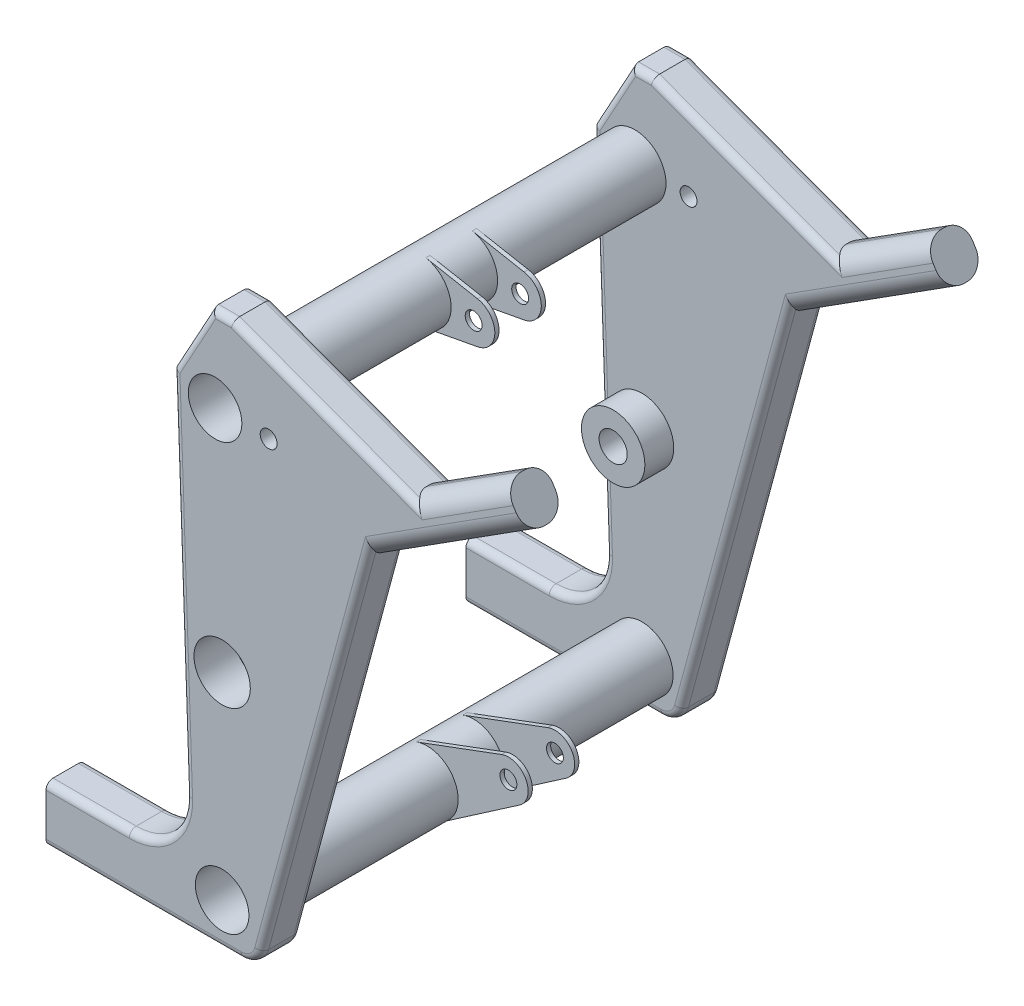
from build123d import *

# Parameters (mm, degrees)
ESQUISSE1_R                  = 22.5
ESQUISSE1_R_2                = 10
EXTRUSION1_DEPTH             = 135.5
ESQUISSE2_R                  = 22
ESQUISSE2_R_2                = 19
EXTRUSION2_DEPTH             = 135
ESQUISSE3_R                  = 22
ESQUISSE3_R_2                = 19
EXTRUSION3_DEPTH             = 135
ESQUISSE6_R                  = 6
ESQUISSE6_R_2                = 19
EXTRUSION4_DEPTH             = 3
R_P_TITION_LIN_AIRE1_COUNT   = 2
R_P_TITION_LIN_AIRE1_PITCH   = 33
ESQUISSE7_R                  = 6
ESQUISSE7_R_2                = 19
EXTRUSION5_DEPTH             = 3
R_P_TITION_LIN_AIRE2_COUNT   = 2
R_P_TITION_LIN_AIRE2_PITCH   = 33
ENL_V_MAT_EXTRU_1_DEPTH      = 114
ENL_V_MAT_EXTRU_1_DEPTH_BACK = 114
ESQUISSE8_R                  = 22.5
ESQUISSE9_R                  = 19
ESQUISSE9_R_2                = 10
ESQUISSE9_R_3                = 6
EXTRUSION6_DEPTH             = 28
R_P_TITION_LIN_AIRE3_COUNT   = 2
R_P_TITION_LIN_AIRE3_PITCH   = 298
ESQUISSE10_R                 = 20
ENL_V_MAT_EXTRU_2_DEPTH      = 28
ESQUISSE11_R                 = 22.5
ENL_V_MAT_EXTRU_3_DEPTH      = 28
CONG_1_R                     = 13
CONG_2_R                     = 13
CONG_4_R                     = 15
CONG_5_R                     = 15
CONG_6_R                     = 40
CONG_3_R                     = 5
CONG_7_R                     = 40
CONG_8_R                     = 5


with BuildPart() as part:
    # Esquisse1 → Extrusion1 (new, symmetric)
    with BuildSketch(Plane.XY):
        Circle(ESQUISSE1_R)
        Circle(ESQUISSE1_R_2, mode=Mode.SUBTRACT)
    extrude(amount=EXTRUSION1_DEPTH, both=True)

    # Esquisse8 → Enl_v. mat.-Extru.1 (cut, two sides: drawn at the far end of the back side and taken through both)
    with BuildSketch(Plane.XY.offset(-ENL_V_MAT_EXTRU_1_DEPTH_BACK)):
        Circle(ESQUISSE8_R)
    extrude(amount=ENL_V_MAT_EXTRU_1_DEPTH + ENL_V_MAT_EXTRU_1_DEPTH_BACK, mode=Mode.SUBTRACT)


with BuildPart() as body_2:
    # Esquisse2 → Extrusion2 (new, symmetric)
    with BuildSketch(Plane.XY):
        with Locations((0, -140)):
            Circle(ESQUISSE2_R)
        with Locations((0, -140)):
            Circle(ESQUISSE2_R_2, mode=Mode.SUBTRACT)
    extrude(amount=EXTRUSION2_DEPTH, both=True)

    # Esquisse7 → Extrusion5 (add)
    with BuildSketch(Plane.XY.offset(15)):
        with BuildLine():
            Line((-7.674599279, -119.382033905), (52.778977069, -96.879476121))
            ThreePointArc((52.778977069, -96.879476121), (70.082495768, -103.538461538), (65.603801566, -121.529991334))
            Line((65.603801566, -121.529991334), (12.47869636, -158.118557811))
            ThreePointArc((12.47869636, -158.118557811), (-19.516644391, -150.153846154), (-7.674599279, -119.382033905))
        make_face()
        with Locations((57.662812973, -110)):
            Circle(ESQUISSE7_R, mode=Mode.SUBTRACT)
        with Locations((0, -140)):
            Circle(ESQUISSE7_R_2, mode=Mode.SUBTRACT)
    extrusion5 = extrude(amount=EXTRUSION5_DEPTH)

    # R_p_tition lin_aire2: Extrusion5 ×2
    with Locations(*[(0, 0, -i * R_P_TITION_LIN_AIRE2_PITCH) for i in range(1, R_P_TITION_LIN_AIRE2_COUNT)]):
        add(extrusion5)


with BuildPart() as body_3:
    # Esquisse3 → Extrusion3 (new, symmetric)
    with BuildSketch(Plane.XY):
        with Locations((-5, 159.921855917)):
            Circle(ESQUISSE3_R)
        with Locations((-5, 159.921855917)):
            Circle(ESQUISSE3_R_2, mode=Mode.SUBTRACT)
    extrude(amount=EXTRUSION3_DEPTH, both=True)

    # Esquisse6 → Extrusion4 (add)
    with BuildSketch(Plane.XY.offset(15)):
        with BuildLine():
            Line((35.763157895, 174.665158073), (-0.947368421, 181.545365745))
            ThreePointArc((-0.947368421, 181.545365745), (-27, 159.921855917), (-0.947368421, 138.298346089))
            Line((-0.947368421, 138.298346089), (35.763157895, 145.178553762))
            ThreePointArc((35.763157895, 145.178553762), (48, 159.921855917), (35.763157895, 174.665158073))
        make_face()
        with Locations((33, 159.921855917)):
            Circle(ESQUISSE6_R, mode=Mode.SUBTRACT)
        with Locations((-5, 159.921855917)):
            Circle(ESQUISSE6_R_2, mode=Mode.SUBTRACT)
    extrusion4 = extrude(amount=EXTRUSION4_DEPTH)

    # R_p_tition lin_aire1: Extrusion4 ×2
    with Locations(*[(0, 0, -i * R_P_TITION_LIN_AIRE1_PITCH) for i in range(1, R_P_TITION_LIN_AIRE1_COUNT)]):
        add(extrusion4)


with BuildPart() as enl_v_mat_extru_1_piece_1:
    # of the separate pieces the step leaves, piece 1, a body of its own (enl_v_mat_extru_1_pieces)
    add(part.part.solids().sort_by_distance((22.5, 0, -135.5))[0])


with BuildPart() as enl_v_mat_extru_1_piece_2:
    # of the separate pieces the step leaves, piece 2, a body of its own (enl_v_mat_extru_1_pieces)
    add(part.part.solids().sort_by_distance((22.5, 0, 114))[0])

    # Esquisse9 → Extrusion6 (add)
    with BuildSketch(Plane.XY.offset(135.5)):
        Polygon((-35, 169.817248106), (-24.530150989, -130), (-125, -130), (-125, -170), (25, -170), (103, 119.68258491), (215.644974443, 191.348346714), (199.54149325, 216.659962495), (132.043851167, 173.71734598), (7.5, 219.921855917), (-7.5, 219.921855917), align=None)
        with Locations((-5, 159.921855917)):
            Circle(ESQUISSE9_R, mode=Mode.SUBTRACT)
        Circle(ESQUISSE9_R_2, mode=Mode.SUBTRACT)
        with Locations((0, -140)):
            Circle(ESQUISSE9_R, mode=Mode.SUBTRACT)
        with Locations((33, 159.921855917)):
            Circle(ESQUISSE9_R_3, mode=Mode.SUBTRACT)
    extrusion6 = extrude(amount=EXTRUSION6_DEPTH)

    # Esquisse10 → Enl_v. mat.-Extru.2 (cut)
    with BuildSketch(Plane.XY.offset(163.5)):
        Circle(ESQUISSE10_R)
    extrude(amount=-ENL_V_MAT_EXTRU_2_DEPTH, mode=Mode.SUBTRACT)

    # Cong_1
    cong_1_edges = [enl_v_mat_extru_1_piece_2.edges().sort_by_distance(p)[0] for p in [
        (159.322487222, 155.515465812, 163.5),
        (165.792672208, 195.188654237, 163.5),
        (159.322487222, 155.515465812, 135.5),
        (165.792672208, 195.188654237, 135.5),
    ]]
    fillet(cong_1_edges, radius=CONG_1_R)

    # Cong_4
    cong_4_edges = [enl_v_mat_extru_1_piece_2.edges().sort_by_distance(p)[0] for p in [
        (25, -170, 149.5),
    ]]
    fillet(cong_4_edges, radius=CONG_4_R)

    # Cong_6
    cong_6_edges = [enl_v_mat_extru_1_piece_2.edges().sort_by_distance(p)[0] for p in [
        (-24.530150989, -130, 149.5),
    ]]
    fillet(cong_6_edges, radius=CONG_6_R)

    # Cong_3
    cong_3_edges = [enl_v_mat_extru_1_piece_2.edges().sort_by_distance(p)[0] for p in [
        (-55.747670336, -170, 135.5),
        (-30.48786523, 40.606613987, 135.5),
        (-21.25, 194.869552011, 135.5),
        (-55.747670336, -170, 163.5),
        (-95.47568177, -130, 135.5),
        (-95.47568177, -130, 163.5),
        (-30.48786523, 40.606613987, 163.5),
        (-21.25, 194.869552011, 163.5),
        (0, 219.921855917, 135.5),
        (0, 219.921855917, 163.5),
        (77.420833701, 193.981933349, 135.5),
        (77.420833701, 193.981933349, 163.5),
        (67.997577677, -10.312186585, 135.5),
        (67.997577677, -10.312186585, 163.5),
        (-37.177771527, -117.786334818, 135.5),
        (-37.177771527, -117.786334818, 163.5),
        (22.628803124, -166.9058809, 135.5),
        (22.628803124, -166.9058809, 163.5),
    ]]
    fillet(cong_3_edges, radius=CONG_3_R)


with BuildPart() as enl_v_mat_extru_1_piece_1_1:
    add(enl_v_mat_extru_1_piece_1.part)

    # R_p_tition lin_aire3: Extrusion6 ×2
    with Locations(*[(0, 0, -i * R_P_TITION_LIN_AIRE3_PITCH) for i in range(1, R_P_TITION_LIN_AIRE3_COUNT)]):
        add(extrusion6)

    # Esquisse11 → Enl_v. mat.-Extru.3 (cut)
    with BuildSketch(Plane(origin=(0, 0, -162.5), x_dir=(-1, 0, 0), z_dir=(0, 0, -1))):
        Circle(ESQUISSE11_R)
    extrude(amount=-ENL_V_MAT_EXTRU_3_DEPTH, mode=Mode.SUBTRACT)


with BuildPart() as enl_v_mat_extru_3_piece_1:
    # of the separate pieces the step leaves, piece 1, a body of its own (enl_v_mat_extru_3_pieces)
    add(enl_v_mat_extru_1_piece_1_1.part.solids().sort_by_distance((-35, 169.817248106, -134.5))[0])

    # Cong_2
    cong_2_edges = [enl_v_mat_extru_3_piece_1.edges().sort_by_distance(p)[0] for p in [
        (159.322487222, 155.515465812, -162.5),
        (165.792672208, 195.188654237, -162.5),
        (159.322487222, 155.515465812, -134.5),
        (165.792672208, 195.188654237, -134.5),
    ]]
    fillet(cong_2_edges, radius=CONG_2_R)

    # Cong_5
    cong_5_edges = [enl_v_mat_extru_3_piece_1.edges().sort_by_distance(p)[0] for p in [
        (25, -170, -148.5),
    ]]
    fillet(cong_5_edges, radius=CONG_5_R)

    # Cong_7
    cong_7_edges = [enl_v_mat_extru_3_piece_1.edges().sort_by_distance(p)[0] for p in [
        (-24.530150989, -130, -148.5),
    ]]
    fillet(cong_7_edges, radius=CONG_7_R)

    # Cong_8
    cong_8_edges = [enl_v_mat_extru_3_piece_1.edges().sort_by_distance(p)[0] for p in [
        (67.997577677, -10.312186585, -162.5),
        (22.628803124, -166.9058809, -162.5),
        (-95.47568177, -130, -162.5),
        (-37.177771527, -117.786334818, -162.5),
        (-55.747670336, -170, -162.5),
        (-30.48786523, 40.606613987, -162.5),
        (-21.25, 194.869552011, -162.5),
        (0, 219.921855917, -162.5),
        (77.420833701, 193.981933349, -162.5),
        (67.997577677, -10.312186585, -134.5),
        (22.628803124, -166.9058809, -134.5),
        (-30.48786523, 40.606613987, -134.5),
        (-37.177771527, -117.786334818, -134.5),
        (77.420833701, 193.981933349, -134.5),
        (0, 219.921855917, -134.5),
        (-55.747670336, -170, -134.5),
        (-21.25, 194.869552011, -134.5),
        (-95.47568177, -130, -134.5),
    ]]
    fillet(cong_8_edges, radius=CONG_8_R)


with BuildPart() as enl_v_mat_extru_3_piece_2:
    # of the separate pieces the step leaves, piece 2, a body of its own (enl_v_mat_extru_3_pieces)
    add(enl_v_mat_extru_1_piece_1_1.part.solids().sort_by_distance((10, 0, -114))[0])


solid = Compound([body_2.part, body_3.part, enl_v_mat_extru_1_piece_2.part, enl_v_mat_extru_3_piece_1.part, enl_v_mat_extru_3_piece_2.part])
